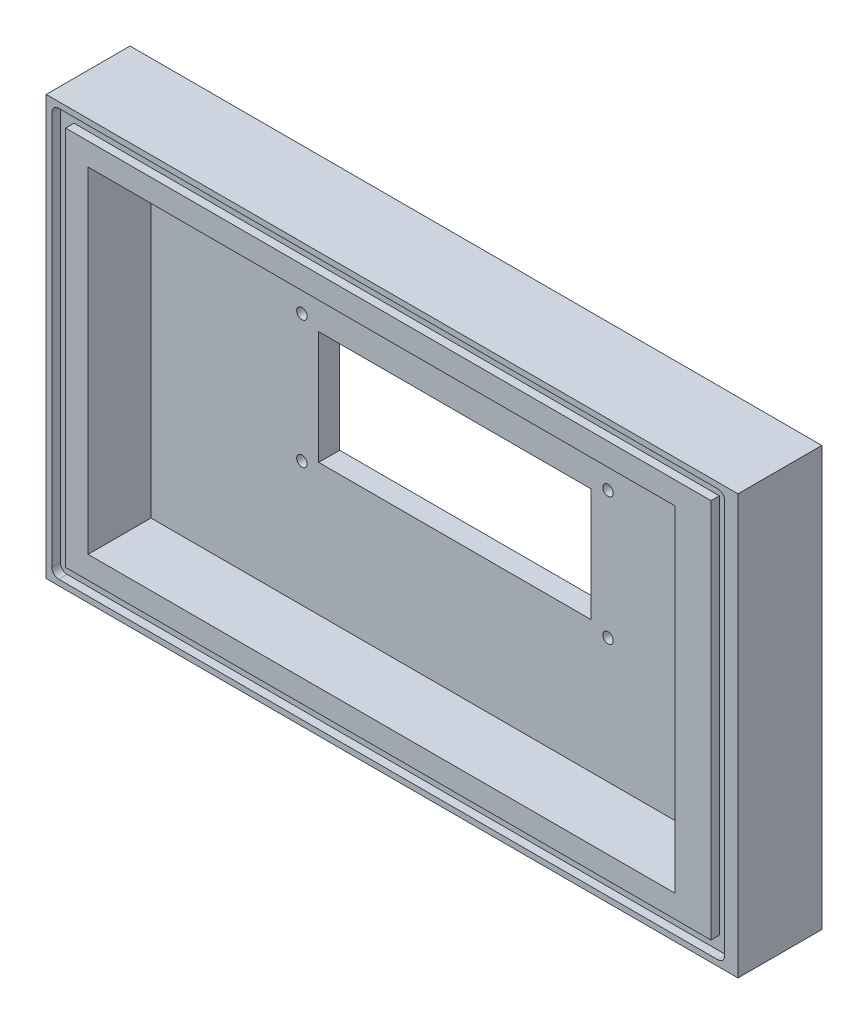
from build123d import *

# Parameters (mm, degrees)
SKIZZE1_W                       = 165
SKIZZE1_H                       = 100
AUFSATZ_LINEAR_AUSTRAGEN1_DEPTH = 20
SKIZZE3_W                       = 140
SKIZZE3_H                       = 80
SCHNITT_LINEAR_AUSTRAGEN1_DEPTH = 15
SKIZZE4_R                       = 1.25
SKIZZE4_W                       = 65
SKIZZE4_H                       = 27
SCHNITT_LINEAR_AUSTRAGEN2_DEPTH = 15
SCHNITT_LINEAR_AUSTRAGEN5_DEPTH = 2


with BuildPart() as part:
    # Skizze1 → Aufsatz-Linear austragen1 (new body)
    with BuildSketch(Plane.XY):
        with Locations((12.629143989, 2.167280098)):
            Rectangle(SKIZZE1_W, SKIZZE1_H)
    extrude(amount=AUFSATZ_LINEAR_AUSTRAGEN1_DEPTH)

    # Skizze3 → Schnitt-Linear austragen1 (cut)
    with BuildSketch(Plane.XY.offset(20)):
        with Locations((10.129143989, 2.167280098)):
            Rectangle(SKIZZE3_W, SKIZZE3_H)
    extrude(amount=-SCHNITT_LINEAR_AUSTRAGEN1_DEPTH, mode=Mode.SUBTRACT)

    # Skizze4 → Schnitt-Linear austragen2 (cut)
    with BuildSketch(Plane.XY.offset(5)):
        with Locations((-23.870856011, 22.392361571)):
            Circle(SKIZZE4_R)
        with Locations((-23.870856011, -8.057801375)):
            Circle(SKIZZE4_R)
        with Locations((49.129143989, 22.392361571)):
            Circle(SKIZZE4_R)
        with Locations((49.129143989, -8.057801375)):
            Circle(SKIZZE4_R)
        with Locations((12.629143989, 7.167280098)):
            Rectangle(SKIZZE4_W, SKIZZE4_H)
    extrude(amount=-SCHNITT_LINEAR_AUSTRAGEN2_DEPTH, mode=Mode.SUBTRACT)

    # Skizze6 → Schnitt-Linear austragen5 (cut)
    with BuildSketch(Plane.XY.offset(20)):
        with BuildLine():
            Line((90.227162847, 50.794367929), (-66.756986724, 50.794367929))
            ThreePointArc((-66.756986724, 50.794367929), (-65.667762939, 50.284796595), (-65.22437869, 49.166994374))
            Line((-65.22437869, 49.166994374), (-65.224663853, 47.540192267))
            Line((-65.224663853, 47.540192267), (88.694554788, 47.540192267))
            Line((88.694554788, 47.540192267), (88.694554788, 49.167280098))
            ThreePointArc((88.694554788, 49.167280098), (89.138037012, 50.284900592), (90.227162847, 50.794367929))
        make_face()
        with BuildLine():
            ThreePointArc((-66.854378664, 47.540192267), (-68.481466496, 49.167280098), (-66.854378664, 50.794367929))
            Line((-66.854378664, 50.794367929), (-66.756986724, 50.794367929))
            ThreePointArc((-66.756986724, 50.794367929), (-67.971895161, 50.353895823), (-68.484378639, 49.167565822))
            Line((-68.484378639, 49.167565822), (-68.500855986, -44.832434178))
            ThreePointArc((-68.500855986, -44.832434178), (-68.023339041, -43.680034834), (-66.870856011, -43.202719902))
            Line((-66.870856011, -43.202719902), (-65.240570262, -43.202719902))
            Line((-65.240570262, -43.202719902), (-65.224663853, 47.540192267))
            Line((-65.224663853, 47.540192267), (-66.854378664, 47.540192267))
        make_face()
        with BuildLine():
            Line((88.694554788, -43.202719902), (-65.240570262, -43.202719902))
            Line((-65.240570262, -43.202719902), (-65.240856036, -44.833005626))
            ThreePointArc((-65.240856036, -44.833005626), (-65.718372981, -45.985404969), (-66.870856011, -46.462719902))
            Line((-66.870856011, -46.462719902), (90.324554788, -46.462719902))
            ThreePointArc((90.324554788, -46.462719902), (89.171970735, -45.985303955), (88.694554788, -44.832719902))
            Line((88.694554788, -44.832719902), (88.694554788, -43.202719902))
        make_face()
        with BuildLine():
            ThreePointArc((91.954554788, 49.167280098), (91.442175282, 50.353797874), (90.227162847, 50.794367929))
            Line((90.227162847, 50.794367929), (90.324554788, 50.794367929))
            ThreePointArc((90.324554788, 50.794367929), (91.951642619, 49.167280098), (90.324554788, 47.540192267))
            Line((90.324554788, 47.540192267), (88.694554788, 47.540192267))
            Line((88.694554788, 47.540192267), (88.694554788, -43.202719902))
            Line((88.694554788, -43.202719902), (90.324554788, -43.202719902))
            ThreePointArc((90.324554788, -43.202719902), (91.477138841, -43.680135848), (91.954554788, -44.832719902))
            Line((91.954554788, -44.832719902), (91.954554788, 49.167280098))
        make_face()
        with BuildLine():
            Line((-66.756986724, 50.794367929), (-66.854378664, 50.794367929))
            ThreePointArc((-66.854378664, 50.794367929), (-68.481466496, 49.167280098), (-66.854378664, 47.540192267))
            Line((-66.854378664, 47.540192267), (-65.224663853, 47.540192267))
            Line((-65.224663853, 47.540192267), (-65.22437869, 49.166994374))
            ThreePointArc((-65.22437869, 49.166994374), (-65.667762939, 50.284796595), (-66.756986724, 50.794367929))
        make_face()
        with BuildLine():
            Line((90.324554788, 50.794367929), (90.227162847, 50.794367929))
            ThreePointArc((90.227162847, 50.794367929), (89.138037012, 50.284900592), (88.694554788, 49.167280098))
            Line((88.694554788, 49.167280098), (88.694554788, 47.540192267))
            Line((88.694554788, 47.540192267), (90.324554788, 47.540192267))
            ThreePointArc((90.324554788, 47.540192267), (91.951642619, 49.167280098), (90.324554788, 50.794367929))
        make_face()
        with BuildLine():
            ThreePointArc((90.324554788, -46.462719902), (91.477138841, -45.985303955), (91.954554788, -44.832719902))
            ThreePointArc((91.954554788, -44.832719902), (91.477138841, -43.680135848), (90.324554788, -43.202719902))
            Line((90.324554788, -43.202719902), (88.694554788, -43.202719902))
            Line((88.694554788, -43.202719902), (88.694554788, -44.832719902))
            ThreePointArc((88.694554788, -44.832719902), (89.171970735, -45.985303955), (90.324554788, -46.462719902))
        make_face()
        with BuildLine():
            ThreePointArc((-66.870856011, -43.202719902), (-68.023339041, -43.680034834), (-68.500855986, -44.832434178))
            ThreePointArc((-68.500855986, -44.832434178), (-68.023541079, -45.985202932), (-66.870856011, -46.462719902))
            ThreePointArc((-66.870856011, -46.462719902), (-65.718372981, -45.985404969), (-65.240856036, -44.833005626))
            Line((-65.240856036, -44.833005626), (-65.240570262, -43.202719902))
            Line((-65.240570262, -43.202719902), (-66.870856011, -43.202719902))
        make_face()
    extrude(amount=-SCHNITT_LINEAR_AUSTRAGEN5_DEPTH, mode=Mode.SUBTRACT)


solid = part.part
